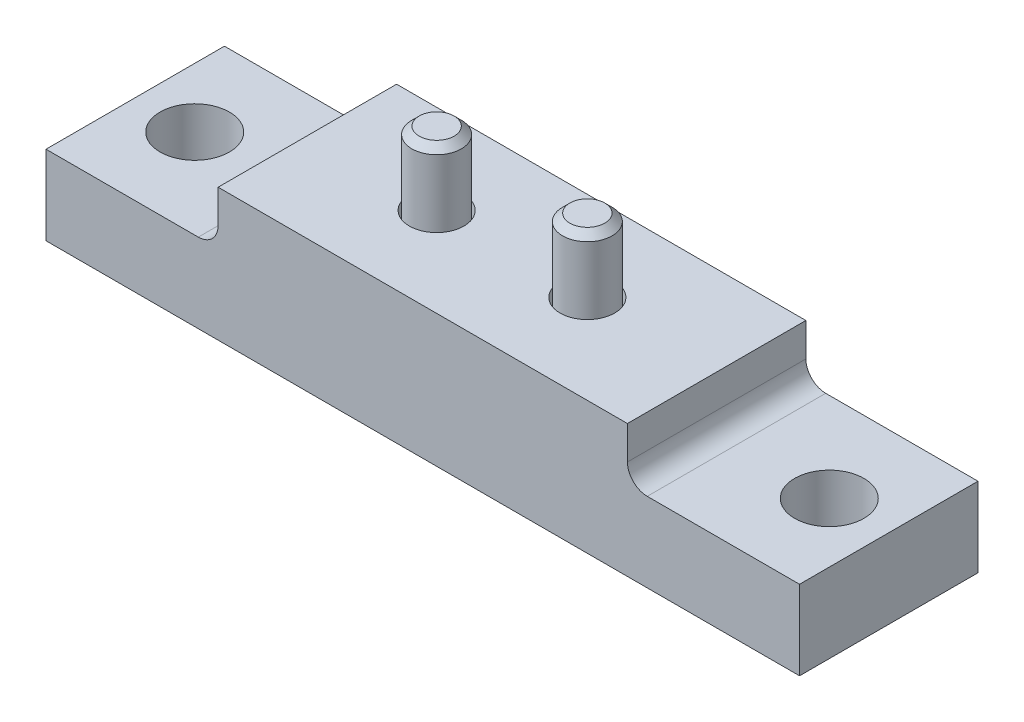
ISO-10303-21;
HEADER;
FILE_DESCRIPTION(('STEP AP214'),'2;1');
FILE_NAME('part.step','',(''),(''),'','','');
FILE_SCHEMA(('AUTOMOTIVE_DESIGN { 1 0 10303 214 1 1 1 1 }'));
ENDSEC;
DATA;
#1=APPLICATION_CONTEXT('core data for automotive mechanical design processes');
#2=APPLICATION_PROTOCOL_DEFINITION('international standard','automotive_design',2000,#1);
#3=PRODUCT_CONTEXT('',#1,'mechanical');
#4=PRODUCT('Part','Part','',(#3));
#5=PRODUCT_RELATED_PRODUCT_CATEGORY('part','',(#4));
#6=PRODUCT_DEFINITION_FORMATION('','',#4);
#7=PRODUCT_DEFINITION_CONTEXT('part definition',#1,'design');
#8=PRODUCT_DEFINITION('design','',#6,#7);
#9=PRODUCT_DEFINITION_SHAPE('','',#8);
#10=(LENGTH_UNIT() NAMED_UNIT(*) SI_UNIT(.MILLI.,.METRE.));
#11=(NAMED_UNIT(*) PLANE_ANGLE_UNIT() SI_UNIT($,.RADIAN.));
#12=(NAMED_UNIT(*) SI_UNIT($,.STERADIAN.) SOLID_ANGLE_UNIT());
#13=UNCERTAINTY_MEASURE_WITH_UNIT(LENGTH_MEASURE(1.E-05),#10,'distance_accuracy_value','');
#14=(GEOMETRIC_REPRESENTATION_CONTEXT(3) GLOBAL_UNCERTAINTY_ASSIGNED_CONTEXT((#13)) GLOBAL_UNIT_ASSIGNED_CONTEXT((#10,
#11,#12)) REPRESENTATION_CONTEXT('',''));
#15=CARTESIAN_POINT('',(0.,0.,0.));
#16=DIRECTION('',(0.,0.,1.));
#17=DIRECTION('',(1.,0.,0.));
#18=AXIS2_PLACEMENT_3D('',#15,#16,#17);
#19=CARTESIAN_POINT('',(8.88999999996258,-14.6431,-8.78823868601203));
#20=DIRECTION('',(0.,1.,0.));
#21=DIRECTION('',(0.,0.,1.));
#22=AXIS2_PLACEMENT_3D('',#19,#20,#21);
#23=PLANE('',#22);
#24=DIRECTION('',(0.,0.,-1.));
#25=VECTOR('',#24,1.);
#26=CARTESIAN_POINT('',(8.88999999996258,-14.6431,-12.4544128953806));
#27=LINE('',#26,#25);
#28=CARTESIAN_POINT('',(8.88999999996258,-14.6431,-12.4544128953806));
#29=VERTEX_POINT('',#28);
#30=CARTESIAN_POINT('',(8.88999999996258,-14.6431,-16.1205871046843));
#31=VERTEX_POINT('',#30);
#32=EDGE_CURVE('E346',#29,#31,#27,.T.);
#33=ORIENTED_EDGE('',*,*,#32,.T.);
#34=DIRECTION('',(0.866025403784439,0.,-0.5));
#35=VECTOR('',#34,1.);
#36=CARTESIAN_POINT('',(8.88999999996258,-14.6431,-16.1205871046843));
#37=LINE('',#36,#35);
#38=CARTESIAN_POINT('',(12.0650000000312,-14.6431,-17.9536742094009));
#39=VERTEX_POINT('',#38);
#40=EDGE_CURVE('E349',#31,#39,#37,.T.);
#41=ORIENTED_EDGE('',*,*,#40,.T.);
#42=DIRECTION('',(0.866025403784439,0.,0.5));
#43=VECTOR('',#42,1.);
#44=CARTESIAN_POINT('',(12.0650000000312,-14.6431,-17.9536742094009));
#45=LINE('',#44,#43);
#46=CARTESIAN_POINT('',(15.2399999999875,-14.6431,-16.1205871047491));
#47=VERTEX_POINT('',#46);
#48=EDGE_CURVE('E352',#39,#47,#45,.T.);
#49=ORIENTED_EDGE('',*,*,#48,.T.);
#50=DIRECTION('',(0.,0.,1.));
#51=VECTOR('',#50,1.);
#52=CARTESIAN_POINT('',(15.2399999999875,-14.6431,-16.1205871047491));
#53=LINE('',#52,#51);
#54=CARTESIAN_POINT('',(15.2399999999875,-14.6431,-12.4544128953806));
#55=VERTEX_POINT('',#54);
#56=EDGE_CURVE('E355',#47,#55,#53,.T.);
#57=ORIENTED_EDGE('',*,*,#56,.T.);
#58=DIRECTION('',(-0.866025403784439,0.,0.5));
#59=VECTOR('',#58,1.);
#60=CARTESIAN_POINT('',(15.2399999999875,-14.6431,-12.4544128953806));
#61=LINE('',#60,#59);
#62=CARTESIAN_POINT('',(12.064999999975,-14.6431,-10.6213257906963));
#63=VERTEX_POINT('',#62);
#64=EDGE_CURVE('E358',#55,#63,#61,.T.);
#65=ORIENTED_EDGE('',*,*,#64,.T.);
#66=DIRECTION('',(-0.866025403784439,0.,-0.5));
#67=VECTOR('',#66,1.);
#68=CARTESIAN_POINT('',(12.064999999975,-14.6431,-10.6213257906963));
#69=LINE('',#68,#67);
#70=EDGE_CURVE('E361',#63,#29,#69,.T.);
#71=ORIENTED_EDGE('',*,*,#70,.T.);
#72=EDGE_LOOP('',(#33,#41,#49,#57,#65,#71));
#73=FACE_BOUND('',#72,.T.);
#74=ADVANCED_FACE('F16',(#73),#23,.F.);
#75=CARTESIAN_POINT('',(8.88999999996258,-14.6431,-16.1205871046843));
#76=DIRECTION('',(-0.5,0.,-0.866025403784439));
#77=DIRECTION('',(0.866025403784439,0.,-0.5));
#78=AXIS2_PLACEMENT_3D('',#75,#76,#77);
#79=PLANE('',#78);
#80=DIRECTION('',(0.866025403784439,0.,-0.5));
#81=VECTOR('',#80,1.);
#82=CARTESIAN_POINT('',(8.88999999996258,-18.4785,-16.1205871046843));
#83=LINE('',#82,#81);
#84=CARTESIAN_POINT('',(8.88999999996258,-18.4785,-16.1205871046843));
#85=VERTEX_POINT('',#84);
#86=CARTESIAN_POINT('',(12.0650000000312,-18.4785,-17.9536742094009));
#87=VERTEX_POINT('',#86);
#88=EDGE_CURVE('E329',#85,#87,#83,.T.);
#89=ORIENTED_EDGE('',*,*,#88,.T.);
#90=DIRECTION('',(0.,-1.,0.));
#91=VECTOR('',#90,1.);
#92=CARTESIAN_POINT('',(12.0650000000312,-14.6431,-17.9536742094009));
#93=LINE('',#92,#91);
#94=EDGE_CURVE('E377',#39,#87,#93,.T.);
#95=ORIENTED_EDGE('',*,*,#94,.F.);
#96=ORIENTED_EDGE('',*,*,#40,.F.);
#97=DIRECTION('',(0.,-1.,0.));
#98=VECTOR('',#97,1.);
#99=CARTESIAN_POINT('',(8.88999999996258,-14.6431,-16.1205871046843));
#100=LINE('',#99,#98);
#101=EDGE_CURVE('E364',#31,#85,#100,.T.);
#102=ORIENTED_EDGE('',*,*,#101,.T.);
#103=EDGE_LOOP('',(#89,#95,#96,#102));
#104=FACE_BOUND('',#103,.T.);
#105=ADVANCED_FACE('F564',(#104),#79,.F.);
#106=CARTESIAN_POINT('',(12.0650000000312,-14.6431,-17.9536742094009));
#107=DIRECTION('',(0.5,0.,-0.866025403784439));
#108=DIRECTION('',(0.866025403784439,0.,0.5));
#109=AXIS2_PLACEMENT_3D('',#106,#107,#108);
#110=PLANE('',#109);
#111=DIRECTION('',(0.866025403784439,0.,0.5));
#112=VECTOR('',#111,1.);
#113=CARTESIAN_POINT('',(12.0650000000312,-18.4785,-17.9536742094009));
#114=LINE('',#113,#112);
#115=CARTESIAN_POINT('',(15.2399999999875,-18.4785,-16.1205871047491));
#116=VERTEX_POINT('',#115);
#117=EDGE_CURVE('E332',#87,#116,#114,.T.);
#118=ORIENTED_EDGE('',*,*,#117,.T.);
#119=DIRECTION('',(0.,-1.,0.));
#120=VECTOR('',#119,1.);
#121=CARTESIAN_POINT('',(15.2399999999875,-14.6431,-16.1205871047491));
#122=LINE('',#121,#120);
#123=EDGE_CURVE('E374',#47,#116,#122,.T.);
#124=ORIENTED_EDGE('',*,*,#123,.F.);
#125=ORIENTED_EDGE('',*,*,#48,.F.);
#126=ORIENTED_EDGE('',*,*,#94,.T.);
#127=EDGE_LOOP('',(#118,#124,#125,#126));
#128=FACE_BOUND('',#127,.T.);
#129=ADVANCED_FACE('F567',(#128),#110,.F.);
#130=CARTESIAN_POINT('',(15.2399999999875,-14.6431,-16.1205871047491));
#131=DIRECTION('',(1.,0.,0.));
#132=DIRECTION('',(0.,0.,1.));
#133=AXIS2_PLACEMENT_3D('',#130,#131,#132);
#134=PLANE('',#133);
#135=DIRECTION('',(0.,0.,1.));
#136=VECTOR('',#135,1.);
#137=CARTESIAN_POINT('',(15.2399999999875,-18.4785,-16.1205871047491));
#138=LINE('',#137,#136);
#139=CARTESIAN_POINT('',(15.2399999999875,-18.4785,-12.4544128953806));
#140=VERTEX_POINT('',#139);
#141=EDGE_CURVE('E337',#116,#140,#138,.T.);
#142=ORIENTED_EDGE('',*,*,#141,.T.);
#143=DIRECTION('',(0.,-1.,0.));
#144=VECTOR('',#143,1.);
#145=CARTESIAN_POINT('',(15.2399999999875,-14.6431,-12.4544128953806));
#146=LINE('',#145,#144);
#147=EDGE_CURVE('E371',#55,#140,#146,.T.);
#148=ORIENTED_EDGE('',*,*,#147,.F.);
#149=ORIENTED_EDGE('',*,*,#56,.F.);
#150=ORIENTED_EDGE('',*,*,#123,.T.);
#151=EDGE_LOOP('',(#142,#148,#149,#150));
#152=FACE_BOUND('',#151,.T.);
#153=ADVANCED_FACE('F571',(#152),#134,.F.);
#154=CARTESIAN_POINT('',(15.2399999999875,-14.6431,-12.4544128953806));
#155=DIRECTION('',(0.5,0.,0.866025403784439));
#156=DIRECTION('',(-0.866025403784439,0.,0.5));
#157=AXIS2_PLACEMENT_3D('',#154,#155,#156);
#158=PLANE('',#157);
#159=DIRECTION('',(-0.866025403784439,0.,0.5));
#160=VECTOR('',#159,1.);
#161=CARTESIAN_POINT('',(15.2399999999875,-18.4785,-12.4544128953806));
#162=LINE('',#161,#160);
#163=CARTESIAN_POINT('',(12.064999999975,-18.4785,-10.6213257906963));
#164=VERTEX_POINT('',#163);
#165=EDGE_CURVE('E340',#140,#164,#162,.T.);
#166=ORIENTED_EDGE('',*,*,#165,.T.);
#167=DIRECTION('',(0.,-1.,0.));
#168=VECTOR('',#167,1.);
#169=CARTESIAN_POINT('',(12.064999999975,-14.6431,-10.6213257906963));
#170=LINE('',#169,#168);
#171=EDGE_CURVE('E368',#63,#164,#170,.T.);
#172=ORIENTED_EDGE('',*,*,#171,.F.);
#173=ORIENTED_EDGE('',*,*,#64,.F.);
#174=ORIENTED_EDGE('',*,*,#147,.T.);
#175=EDGE_LOOP('',(#166,#172,#173,#174));
#176=FACE_BOUND('',#175,.T.);
#177=ADVANCED_FACE('F575',(#176),#158,.F.);
#178=CARTESIAN_POINT('',(12.064999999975,-14.6431,-10.6213257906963));
#179=DIRECTION('',(-0.5,0.,0.866025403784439));
#180=DIRECTION('',(-0.866025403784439,0.,-0.5));
#181=AXIS2_PLACEMENT_3D('',#178,#179,#180);
#182=PLANE('',#181);
#183=DIRECTION('',(-0.866025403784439,0.,-0.5));
#184=VECTOR('',#183,1.);
#185=CARTESIAN_POINT('',(12.064999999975,-18.4785,-10.6213257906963));
#186=LINE('',#185,#184);
#187=CARTESIAN_POINT('',(8.88999999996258,-18.4785,-12.4544128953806));
#188=VERTEX_POINT('',#187);
#189=EDGE_CURVE('E343',#164,#188,#186,.T.);
#190=ORIENTED_EDGE('',*,*,#189,.T.);
#191=DIRECTION('',(0.,-1.,0.));
#192=VECTOR('',#191,1.);
#193=CARTESIAN_POINT('',(8.88999999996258,-14.6431,-12.4544128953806));
#194=LINE('',#193,#192);
#195=EDGE_CURVE('E365',#29,#188,#194,.T.);
#196=ORIENTED_EDGE('',*,*,#195,.F.);
#197=ORIENTED_EDGE('',*,*,#70,.F.);
#198=ORIENTED_EDGE('',*,*,#171,.T.);
#199=EDGE_LOOP('',(#190,#196,#197,#198));
#200=FACE_BOUND('',#199,.T.);
#201=ADVANCED_FACE('F563',(#200),#182,.F.);
#202=CARTESIAN_POINT('',(8.88999999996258,-14.6431,-12.4544128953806));
#203=DIRECTION('',(-1.,0.,0.));
#204=DIRECTION('',(0.,0.,-1.));
#205=AXIS2_PLACEMENT_3D('',#202,#203,#204);
#206=PLANE('',#205);
#207=DIRECTION('',(0.,0.,-1.));
#208=VECTOR('',#207,1.);
#209=CARTESIAN_POINT('',(8.88999999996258,-18.4785,-12.4544128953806));
#210=LINE('',#209,#208);
#211=EDGE_CURVE('E35',#188,#85,#210,.T.);
#212=ORIENTED_EDGE('',*,*,#211,.T.);
#213=ORIENTED_EDGE('',*,*,#101,.F.);
#214=ORIENTED_EDGE('',*,*,#32,.F.);
#215=ORIENTED_EDGE('',*,*,#195,.T.);
#216=EDGE_LOOP('',(#212,#213,#214,#215));
#217=FACE_BOUND('',#216,.T.);
#218=ADVANCED_FACE('F547',(#217),#206,.F.);
#219=CARTESIAN_POINT('',(17.423384,-18.4785,-14.2875));
#220=DIRECTION('',(0.,-1.,0.));
#221=DIRECTION('',(0.,0.,-1.));
#222=AXIS2_PLACEMENT_3D('',#219,#220,#221);
#223=PLANE('',#222);
#224=ORIENTED_EDGE('',*,*,#211,.F.);
#225=ORIENTED_EDGE('',*,*,#189,.F.);
#226=ORIENTED_EDGE('',*,*,#165,.F.);
#227=ORIENTED_EDGE('',*,*,#141,.F.);
#228=ORIENTED_EDGE('',*,*,#117,.F.);
#229=ORIENTED_EDGE('',*,*,#88,.F.);
#230=EDGE_LOOP('',(#224,#225,#226,#227,#228,#229));
#231=FACE_BOUND('',#230,.T.);
#232=CARTESIAN_POINT('',(12.065,-18.4785,-14.2875));
#233=DIRECTION('',(0.,1.,0.));
#234=DIRECTION('',(0.,0.,1.));
#235=AXIS2_PLACEMENT_3D('',#232,#233,#234);
#236=CIRCLE('',#235,5.358384);
#237=CARTESIAN_POINT('',(12.065,-18.4785,-8.929116));
#238=VERTEX_POINT('',#237);
#239=EDGE_CURVE('E386',#238,#238,#236,.T.);
#240=ORIENTED_EDGE('',*,*,#239,.F.);
#241=EDGE_LOOP('',(#240));
#242=FACE_BOUND('',#241,.T.);
#243=ADVANCED_FACE('F543',(#231,#242),#223,.T.);
#244=CARTESIAN_POINT('',(12.065,-17.883124,-14.2875));
#245=DIRECTION('',(0.,1.,0.));
#246=DIRECTION('',(0.,0.,1.));
#247=AXIS2_PLACEMENT_3D('',#244,#245,#246);
#248=CONICAL_SURFACE('',#247,5.95376,0.785398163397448);
#249=ORIENTED_EDGE('',*,*,#239,.T.);
#250=EDGE_LOOP('',(#249));
#251=FACE_BOUND('',#250,.T.);
#252=CARTESIAN_POINT('',(12.065,-17.883124,-14.2875));
#253=DIRECTION('',(0.,1.,0.));
#254=DIRECTION('',(0.,0.,1.));
#255=AXIS2_PLACEMENT_3D('',#252,#253,#254);
#256=CIRCLE('',#255,5.95376);
#257=CARTESIAN_POINT('',(12.065,-17.883124,-8.33374));
#258=VERTEX_POINT('',#257);
#259=EDGE_CURVE('E389',#258,#258,#256,.T.);
#260=ORIENTED_EDGE('',*,*,#259,.F.);
#261=EDGE_LOOP('',(#260));
#262=FACE_BOUND('',#261,.T.);
#263=ADVANCED_FACE('F539',(#251,#262),#248,.T.);
#264=CARTESIAN_POINT('',(12.065,-10.541,-14.2875));
#265=DIRECTION('',(0.,1.,0.));
#266=DIRECTION('',(0.,0.,1.));
#267=AXIS2_PLACEMENT_3D('',#264,#265,#266);
#268=CYLINDRICAL_SURFACE('',#267,5.95376);
#269=ORIENTED_EDGE('',*,*,#259,.T.);
#270=EDGE_LOOP('',(#269));
#271=FACE_BOUND('',#270,.T.);
#272=CARTESIAN_POINT('',(12.065,-10.541,-14.2875));
#273=DIRECTION('',(0.,1.,0.));
#274=DIRECTION('',(0.,0.,1.));
#275=AXIS2_PLACEMENT_3D('',#272,#273,#274);
#276=CIRCLE('',#275,5.95376);
#277=CARTESIAN_POINT('',(12.065,-10.541,-8.33374));
#278=VERTEX_POINT('',#277);
#279=EDGE_CURVE('E392',#278,#278,#276,.T.);
#280=ORIENTED_EDGE('',*,*,#279,.F.);
#281=EDGE_LOOP('',(#280));
#282=FACE_BOUND('',#281,.T.);
#283=ADVANCED_FACE('F535',(#271,#282),#268,.T.);
#284=CARTESIAN_POINT('',(12.065,-10.541,-14.2875));
#285=DIRECTION('',(0.,1.,0.));
#286=DIRECTION('',(0.,0.,1.));
#287=AXIS2_PLACEMENT_3D('',#284,#285,#286);
#288=PLANE('',#287);
#289=CARTESIAN_POINT('',(12.065,-10.541,-14.2875));
#290=DIRECTION('',(0.,1.,0.));
#291=DIRECTION('',(0.,0.,1.));
#292=AXIS2_PLACEMENT_3D('',#289,#290,#291);
#293=CIRCLE('',#292,3.96875);
#294=CARTESIAN_POINT('',(12.065,-10.541,-10.31875));
#295=VERTEX_POINT('',#294);
#296=EDGE_CURVE('E26',#295,#295,#293,.T.);
#297=ORIENTED_EDGE('',*,*,#296,.F.);
#298=EDGE_LOOP('',(#297));
#299=FACE_BOUND('',#298,.T.);
#300=CARTESIAN_POINT('',(12.065,-10.541,-14.2875));
#301=DIRECTION('',(0.,1.,0.));
#302=DIRECTION('',(0.,0.,1.));
#303=AXIS2_PLACEMENT_3D('',#300,#301,#302);
#304=CIRCLE('',#303,4.3688);
#305=CARTESIAN_POINT('',(12.065,-10.541,-9.9187));
#306=VERTEX_POINT('',#305);
#307=EDGE_CURVE('E10',#306,#306,#304,.T.);
#308=ORIENTED_EDGE('',*,*,#307,.T.);
#309=EDGE_LOOP('',(#308));
#310=FACE_BOUND('',#309,.T.);
#311=ADVANCED_FACE('F531',(#299,#310),#288,.T.);
#312=CARTESIAN_POINT('',(12.065,11.684,-14.2875));
#313=DIRECTION('',(0.,1.,0.));
#314=DIRECTION('',(0.,0.,1.));
#315=AXIS2_PLACEMENT_3D('',#312,#313,#314);
#316=PLANE('',#315);
#317=CARTESIAN_POINT('',(12.065,11.684,-14.2875));
#318=DIRECTION('',(0.,1.,0.));
#319=DIRECTION('',(0.,0.,1.));
#320=AXIS2_PLACEMENT_3D('',#317,#318,#319);
#321=CIRCLE('',#320,2.79768935);
#322=CARTESIAN_POINT('',(12.065,11.684,-11.48981065));
#323=VERTEX_POINT('',#322);
#324=EDGE_CURVE('E383',#323,#323,#321,.T.);
#325=ORIENTED_EDGE('',*,*,#324,.T.);
#326=EDGE_LOOP('',(#325));
#327=FACE_BOUND('',#326,.T.);
#328=ADVANCED_FACE('F534',(#327),#316,.T.);
#329=CARTESIAN_POINT('',(12.065,11.684,-14.2875));
#330=DIRECTION('',(0.,-1.,0.));
#331=DIRECTION('',(0.,0.,-1.));
#332=AXIS2_PLACEMENT_3D('',#329,#330,#331);
#333=CONICAL_SURFACE('',#332,2.79768935,0.78539816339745);
#334=CARTESIAN_POINT('',(12.065,10.51293935,-14.2875));
#335=DIRECTION('',(0.,1.,0.));
#336=DIRECTION('',(0.,0.,1.));
#337=AXIS2_PLACEMENT_3D('',#334,#335,#336);
#338=CIRCLE('',#337,3.96875);
#339=CARTESIAN_POINT('',(12.065,10.51293935,-10.31875));
#340=VERTEX_POINT('',#339);
#341=EDGE_CURVE('E367',#340,#340,#338,.T.);
#342=ORIENTED_EDGE('',*,*,#341,.T.);
#343=EDGE_LOOP('',(#342));
#344=FACE_BOUND('',#343,.T.);
#345=ORIENTED_EDGE('',*,*,#324,.F.);
#346=EDGE_LOOP('',(#345));
#347=FACE_BOUND('',#346,.T.);
#348=ADVANCED_FACE('F551',(#344,#347),#333,.T.);
#349=CARTESIAN_POINT('',(12.065,-10.541,-14.2875));
#350=DIRECTION('',(0.,1.,0.));
#351=DIRECTION('',(0.,0.,1.));
#352=AXIS2_PLACEMENT_3D('',#349,#350,#351);
#353=CYLINDRICAL_SURFACE('',#352,3.96875);
#354=ORIENTED_EDGE('',*,*,#296,.T.);
#355=EDGE_LOOP('',(#354));
#356=FACE_BOUND('',#355,.T.);
#357=ORIENTED_EDGE('',*,*,#341,.F.);
#358=EDGE_LOOP('',(#357));
#359=FACE_BOUND('',#358,.T.);
#360=ADVANCED_FACE('F555',(#356,#359),#353,.T.);
#361=CARTESIAN_POINT('',(-15.2400000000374,-14.6431,-8.78823868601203));
#362=DIRECTION('',(0.,1.,0.));
#363=DIRECTION('',(0.,0.,1.));
#364=AXIS2_PLACEMENT_3D('',#361,#362,#363);
#365=PLANE('',#364);
#366=DIRECTION('',(0.,0.,-1.));
#367=VECTOR('',#366,1.);
#368=CARTESIAN_POINT('',(-15.2400000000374,-14.6431,-12.4544128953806));
#369=LINE('',#368,#367);
#370=CARTESIAN_POINT('',(-15.2400000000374,-14.6431,-12.4544128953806));
#371=VERTEX_POINT('',#370);
#372=CARTESIAN_POINT('',(-15.2400000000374,-14.6431,-16.1205871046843));
#373=VERTEX_POINT('',#372);
#374=EDGE_CURVE('E179',#371,#373,#369,.T.);
#375=ORIENTED_EDGE('',*,*,#374,.T.);
#376=DIRECTION('',(0.866025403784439,0.,-0.5));
#377=VECTOR('',#376,1.);
#378=CARTESIAN_POINT('',(-15.2400000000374,-14.6431,-16.1205871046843));
#379=LINE('',#378,#377);
#380=CARTESIAN_POINT('',(-12.0649999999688,-14.6431,-17.9536742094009));
#381=VERTEX_POINT('',#380);
#382=EDGE_CURVE('E157',#373,#381,#379,.T.);
#383=ORIENTED_EDGE('',*,*,#382,.T.);
#384=DIRECTION('',(0.866025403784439,0.,0.5));
#385=VECTOR('',#384,1.);
#386=CARTESIAN_POINT('',(-12.0649999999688,-14.6431,-17.9536742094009));
#387=LINE('',#386,#385);
#388=CARTESIAN_POINT('',(-8.89000000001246,-14.6431,-16.1205871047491));
#389=VERTEX_POINT('',#388);
#390=EDGE_CURVE('E182',#381,#389,#387,.T.);
#391=ORIENTED_EDGE('',*,*,#390,.T.);
#392=DIRECTION('',(0.,0.,1.));
#393=VECTOR('',#392,1.);
#394=CARTESIAN_POINT('',(-8.89000000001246,-14.6431,-16.1205871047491));
#395=LINE('',#394,#393);
#396=CARTESIAN_POINT('',(-8.89000000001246,-14.6431,-12.4544128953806));
#397=VERTEX_POINT('',#396);
#398=EDGE_CURVE('E185',#389,#397,#395,.T.);
#399=ORIENTED_EDGE('',*,*,#398,.T.);
#400=DIRECTION('',(-0.866025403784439,0.,0.5));
#401=VECTOR('',#400,1.);
#402=CARTESIAN_POINT('',(-8.89000000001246,-14.6431,-12.4544128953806));
#403=LINE('',#402,#401);
#404=CARTESIAN_POINT('',(-12.0650000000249,-14.6431,-10.6213257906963));
#405=VERTEX_POINT('',#404);
#406=EDGE_CURVE('E188',#397,#405,#403,.T.);
#407=ORIENTED_EDGE('',*,*,#406,.T.);
#408=DIRECTION('',(-0.866025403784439,0.,-0.5));
#409=VECTOR('',#408,1.);
#410=CARTESIAN_POINT('',(-12.0650000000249,-14.6431,-10.6213257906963));
#411=LINE('',#410,#409);
#412=EDGE_CURVE('E160',#405,#371,#411,.T.);
#413=ORIENTED_EDGE('',*,*,#412,.T.);
#414=EDGE_LOOP('',(#375,#383,#391,#399,#407,#413));
#415=FACE_BOUND('',#414,.T.);
#416=ADVANCED_FACE('F559',(#415),#365,.F.);
#417=CARTESIAN_POINT('',(-15.2400000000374,-14.6431,-16.1205871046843));
#418=DIRECTION('',(-0.5,0.,-0.866025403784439));
#419=DIRECTION('',(0.866025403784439,0.,-0.5));
#420=AXIS2_PLACEMENT_3D('',#417,#418,#419);
#421=PLANE('',#420);
#422=DIRECTION('',(0.866025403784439,0.,-0.5));
#423=VECTOR('',#422,1.);
#424=CARTESIAN_POINT('',(-15.2400000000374,-18.4785,-16.1205871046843));
#425=LINE('',#424,#423);
#426=CARTESIAN_POINT('',(-15.2400000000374,-18.4785,-16.1205871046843));
#427=VERTEX_POINT('',#426);
#428=CARTESIAN_POINT('',(-12.0649999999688,-18.4785,-17.9536742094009));
#429=VERTEX_POINT('',#428);
#430=EDGE_CURVE('E150',#427,#429,#425,.T.);
#431=ORIENTED_EDGE('',*,*,#430,.T.);
#432=DIRECTION('',(0.,-1.,0.));
#433=VECTOR('',#432,1.);
#434=CARTESIAN_POINT('',(-12.0649999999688,-14.6431,-17.9536742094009));
#435=LINE('',#434,#433);
#436=EDGE_CURVE('E159',#381,#429,#435,.T.);
#437=ORIENTED_EDGE('',*,*,#436,.F.);
#438=ORIENTED_EDGE('',*,*,#382,.F.);
#439=DIRECTION('',(0.,-1.,0.));
#440=VECTOR('',#439,1.);
#441=CARTESIAN_POINT('',(-15.2400000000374,-14.6431,-16.1205871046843));
#442=LINE('',#441,#440);
#443=EDGE_CURVE('E145',#373,#427,#442,.T.);
#444=ORIENTED_EDGE('',*,*,#443,.T.);
#445=EDGE_LOOP('',(#431,#437,#438,#444));
#446=FACE_BOUND('',#445,.T.);
#447=ADVANCED_FACE('F154',(#446),#421,.F.);
#448=CARTESIAN_POINT('',(-12.0649999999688,-14.6431,-17.9536742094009));
#449=DIRECTION('',(0.5,0.,-0.866025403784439));
#450=DIRECTION('',(0.866025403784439,0.,0.5));
#451=AXIS2_PLACEMENT_3D('',#448,#449,#450);
#452=PLANE('',#451);
#453=DIRECTION('',(0.866025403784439,0.,0.5));
#454=VECTOR('',#453,1.);
#455=CARTESIAN_POINT('',(-12.0649999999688,-18.4785,-17.9536742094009));
#456=LINE('',#455,#454);
#457=CARTESIAN_POINT('',(-8.89000000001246,-18.4785,-16.1205871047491));
#458=VERTEX_POINT('',#457);
#459=EDGE_CURVE('E166',#429,#458,#456,.T.);
#460=ORIENTED_EDGE('',*,*,#459,.T.);
#461=DIRECTION('',(0.,-1.,0.));
#462=VECTOR('',#461,1.);
#463=CARTESIAN_POINT('',(-8.89000000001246,-14.6431,-16.1205871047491));
#464=LINE('',#463,#462);
#465=EDGE_CURVE('E199',#389,#458,#464,.T.);
#466=ORIENTED_EDGE('',*,*,#465,.F.);
#467=ORIENTED_EDGE('',*,*,#390,.F.);
#468=ORIENTED_EDGE('',*,*,#436,.T.);
#469=EDGE_LOOP('',(#460,#466,#467,#468));
#470=FACE_BOUND('',#469,.T.);
#471=ADVANCED_FACE('F594',(#470),#452,.F.);
#472=CARTESIAN_POINT('',(-8.89000000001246,-14.6431,-16.1205871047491));
#473=DIRECTION('',(1.,0.,0.));
#474=DIRECTION('',(0.,0.,1.));
#475=AXIS2_PLACEMENT_3D('',#472,#473,#474);
#476=PLANE('',#475);
#477=DIRECTION('',(0.,0.,1.));
#478=VECTOR('',#477,1.);
#479=CARTESIAN_POINT('',(-8.89000000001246,-18.4785,-16.1205871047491));
#480=LINE('',#479,#478);
#481=CARTESIAN_POINT('',(-8.89000000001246,-18.4785,-12.4544128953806));
#482=VERTEX_POINT('',#481);
#483=EDGE_CURVE('E168',#458,#482,#480,.T.);
#484=ORIENTED_EDGE('',*,*,#483,.T.);
#485=DIRECTION('',(0.,-1.,0.));
#486=VECTOR('',#485,1.);
#487=CARTESIAN_POINT('',(-8.89000000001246,-14.6431,-12.4544128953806));
#488=LINE('',#487,#486);
#489=EDGE_CURVE('E197',#397,#482,#488,.T.);
#490=ORIENTED_EDGE('',*,*,#489,.F.);
#491=ORIENTED_EDGE('',*,*,#398,.F.);
#492=ORIENTED_EDGE('',*,*,#465,.T.);
#493=EDGE_LOOP('',(#484,#490,#491,#492));
#494=FACE_BOUND('',#493,.T.);
#495=ADVANCED_FACE('F603',(#494),#476,.F.);
#496=CARTESIAN_POINT('',(-8.89000000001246,-14.6431,-12.4544128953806));
#497=DIRECTION('',(0.5,0.,0.866025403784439));
#498=DIRECTION('',(-0.866025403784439,0.,0.5));
#499=AXIS2_PLACEMENT_3D('',#496,#497,#498);
#500=PLANE('',#499);
#501=DIRECTION('',(-0.866025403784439,0.,0.5));
#502=VECTOR('',#501,1.);
#503=CARTESIAN_POINT('',(-8.89000000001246,-18.4785,-12.4544128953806));
#504=LINE('',#503,#502);
#505=CARTESIAN_POINT('',(-12.0650000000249,-18.4785,-10.6213257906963));
#506=VERTEX_POINT('',#505);
#507=EDGE_CURVE('E174',#482,#506,#504,.T.);
#508=ORIENTED_EDGE('',*,*,#507,.T.);
#509=DIRECTION('',(0.,-1.,0.));
#510=VECTOR('',#509,1.);
#511=CARTESIAN_POINT('',(-12.0650000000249,-14.6431,-10.6213257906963));
#512=LINE('',#511,#510);
#513=EDGE_CURVE('E195',#405,#506,#512,.T.);
#514=ORIENTED_EDGE('',*,*,#513,.F.);
#515=ORIENTED_EDGE('',*,*,#406,.F.);
#516=ORIENTED_EDGE('',*,*,#489,.T.);
#517=EDGE_LOOP('',(#508,#514,#515,#516));
#518=FACE_BOUND('',#517,.T.);
#519=ADVANCED_FACE('F600',(#518),#500,.F.);
#520=CARTESIAN_POINT('',(-12.0650000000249,-14.6431,-10.6213257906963));
#521=DIRECTION('',(-0.5,0.,0.866025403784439));
#522=DIRECTION('',(-0.866025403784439,0.,-0.5));
#523=AXIS2_PLACEMENT_3D('',#520,#521,#522);
#524=PLANE('',#523);
#525=DIRECTION('',(-0.866025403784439,0.,-0.5));
#526=VECTOR('',#525,1.);
#527=CARTESIAN_POINT('',(-12.0650000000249,-18.4785,-10.6213257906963));
#528=LINE('',#527,#526);
#529=CARTESIAN_POINT('',(-15.2400000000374,-18.4785,-12.4544128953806));
#530=VERTEX_POINT('',#529);
#531=EDGE_CURVE('E177',#506,#530,#528,.T.);
#532=ORIENTED_EDGE('',*,*,#531,.T.);
#533=DIRECTION('',(0.,-1.,0.));
#534=VECTOR('',#533,1.);
#535=CARTESIAN_POINT('',(-15.2400000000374,-14.6431,-12.4544128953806));
#536=LINE('',#535,#534);
#537=EDGE_CURVE('E137',#371,#530,#536,.T.);
#538=ORIENTED_EDGE('',*,*,#537,.F.);
#539=ORIENTED_EDGE('',*,*,#412,.F.);
#540=ORIENTED_EDGE('',*,*,#513,.T.);
#541=EDGE_LOOP('',(#532,#538,#539,#540));
#542=FACE_BOUND('',#541,.T.);
#543=ADVANCED_FACE('F597',(#542),#524,.F.);
#544=CARTESIAN_POINT('',(-15.2400000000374,-14.6431,-12.4544128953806));
#545=DIRECTION('',(-1.,0.,0.));
#546=DIRECTION('',(0.,0.,-1.));
#547=AXIS2_PLACEMENT_3D('',#544,#545,#546);
#548=PLANE('',#547);
#549=DIRECTION('',(0.,0.,-1.));
#550=VECTOR('',#549,1.);
#551=CARTESIAN_POINT('',(-15.2400000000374,-18.4785,-12.4544128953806));
#552=LINE('',#551,#550);
#553=EDGE_CURVE('E142',#530,#427,#552,.T.);
#554=ORIENTED_EDGE('',*,*,#553,.T.);
#555=ORIENTED_EDGE('',*,*,#443,.F.);
#556=ORIENTED_EDGE('',*,*,#374,.F.);
#557=ORIENTED_EDGE('',*,*,#537,.T.);
#558=EDGE_LOOP('',(#554,#555,#556,#557));
#559=FACE_BOUND('',#558,.T.);
#560=ADVANCED_FACE('F144',(#559),#548,.F.);
#561=CARTESIAN_POINT('',(-6.706616,-18.4785,-14.2875));
#562=DIRECTION('',(0.,-1.,0.));
#563=DIRECTION('',(0.,0.,-1.));
#564=AXIS2_PLACEMENT_3D('',#561,#562,#563);
#565=PLANE('',#564);
#566=ORIENTED_EDGE('',*,*,#553,.F.);
#567=ORIENTED_EDGE('',*,*,#531,.F.);
#568=ORIENTED_EDGE('',*,*,#507,.F.);
#569=ORIENTED_EDGE('',*,*,#483,.F.);
#570=ORIENTED_EDGE('',*,*,#459,.F.);
#571=ORIENTED_EDGE('',*,*,#430,.F.);
#572=EDGE_LOOP('',(#566,#567,#568,#569,#570,#571));
#573=FACE_BOUND('',#572,.T.);
#574=CARTESIAN_POINT('',(-12.065,-18.4785,-14.2875));
#575=DIRECTION('',(0.,1.,0.));
#576=DIRECTION('',(0.,0.,1.));
#577=AXIS2_PLACEMENT_3D('',#574,#575,#576);
#578=CIRCLE('',#577,5.358384);
#579=CARTESIAN_POINT('',(-12.065,-18.4785,-8.929116));
#580=VERTEX_POINT('',#579);
#581=EDGE_CURVE('E207',#580,#580,#578,.T.);
#582=ORIENTED_EDGE('',*,*,#581,.F.);
#583=EDGE_LOOP('',(#582));
#584=FACE_BOUND('',#583,.T.);
#585=ADVANCED_FACE('F162',(#573,#584),#565,.T.);
#586=CARTESIAN_POINT('',(-12.065,11.684,-14.2875));
#587=DIRECTION('',(0.,1.,0.));
#588=DIRECTION('',(0.,0.,1.));
#589=AXIS2_PLACEMENT_3D('',#586,#587,#588);
#590=PLANE('',#589);
#591=CARTESIAN_POINT('',(-12.065,11.684,-14.2875));
#592=DIRECTION('',(0.,1.,0.));
#593=DIRECTION('',(0.,0.,1.));
#594=AXIS2_PLACEMENT_3D('',#591,#592,#593);
#595=CIRCLE('',#594,2.79768935);
#596=CARTESIAN_POINT('',(-12.065,11.684,-11.48981065));
#597=VERTEX_POINT('',#596);
#598=EDGE_CURVE('E204',#597,#597,#595,.T.);
#599=ORIENTED_EDGE('',*,*,#598,.T.);
#600=EDGE_LOOP('',(#599));
#601=FACE_BOUND('',#600,.T.);
#602=ADVANCED_FACE('F621',(#601),#590,.T.);
#603=CARTESIAN_POINT('',(-12.065,-17.883124,-14.2875));
#604=DIRECTION('',(0.,1.,0.));
#605=DIRECTION('',(0.,0.,1.));
#606=AXIS2_PLACEMENT_3D('',#603,#604,#605);
#607=CONICAL_SURFACE('',#606,5.95376,0.785398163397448);
#608=ORIENTED_EDGE('',*,*,#581,.T.);
#609=EDGE_LOOP('',(#608));
#610=FACE_BOUND('',#609,.T.);
#611=CARTESIAN_POINT('',(-12.065,-17.883124,-14.2875));
#612=DIRECTION('',(0.,1.,0.));
#613=DIRECTION('',(0.,0.,1.));
#614=AXIS2_PLACEMENT_3D('',#611,#612,#613);
#615=CIRCLE('',#614,5.95376);
#616=CARTESIAN_POINT('',(-12.065,-17.883124,-8.33374));
#617=VERTEX_POINT('',#616);
#618=EDGE_CURVE('E209',#617,#617,#615,.T.);
#619=ORIENTED_EDGE('',*,*,#618,.F.);
#620=EDGE_LOOP('',(#619));
#621=FACE_BOUND('',#620,.T.);
#622=ADVANCED_FACE('F619',(#610,#621),#607,.T.);
#623=CARTESIAN_POINT('',(-12.065,11.684,-14.2875));
#624=DIRECTION('',(0.,-1.,0.));
#625=DIRECTION('',(0.,0.,-1.));
#626=AXIS2_PLACEMENT_3D('',#623,#624,#625);
#627=CONICAL_SURFACE('',#626,2.79768935,0.78539816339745);
#628=CARTESIAN_POINT('',(-12.065,10.51293935,-14.2875));
#629=DIRECTION('',(0.,1.,0.));
#630=DIRECTION('',(0.,0.,1.));
#631=AXIS2_PLACEMENT_3D('',#628,#629,#630);
#632=CIRCLE('',#631,3.96875);
#633=CARTESIAN_POINT('',(-12.065,10.51293935,-10.31875));
#634=VERTEX_POINT('',#633);
#635=EDGE_CURVE('E194',#634,#634,#632,.T.);
#636=ORIENTED_EDGE('',*,*,#635,.T.);
#637=EDGE_LOOP('',(#636));
#638=FACE_BOUND('',#637,.T.);
#639=ORIENTED_EDGE('',*,*,#598,.F.);
#640=EDGE_LOOP('',(#639));
#641=FACE_BOUND('',#640,.T.);
#642=ADVANCED_FACE('F616',(#638,#641),#627,.T.);
#643=CARTESIAN_POINT('',(-12.065,-10.541,-14.2875));
#644=DIRECTION('',(0.,1.,0.));
#645=DIRECTION('',(0.,0.,1.));
#646=AXIS2_PLACEMENT_3D('',#643,#644,#645);
#647=CYLINDRICAL_SURFACE('',#646,5.95376);
#648=ORIENTED_EDGE('',*,*,#618,.T.);
#649=EDGE_LOOP('',(#648));
#650=FACE_BOUND('',#649,.T.);
#651=CARTESIAN_POINT('',(-12.065,-10.541,-14.2875));
#652=DIRECTION('',(0.,1.,0.));
#653=DIRECTION('',(0.,0.,1.));
#654=AXIS2_PLACEMENT_3D('',#651,#652,#653);
#655=CIRCLE('',#654,5.95376);
#656=CARTESIAN_POINT('',(-12.065,-10.541,-8.33374));
#657=VERTEX_POINT('',#656);
#658=EDGE_CURVE('E325',#657,#657,#655,.T.);
#659=ORIENTED_EDGE('',*,*,#658,.F.);
#660=EDGE_LOOP('',(#659));
#661=FACE_BOUND('',#660,.T.);
#662=ADVANCED_FACE('F615',(#650,#661),#647,.T.);
#663=CARTESIAN_POINT('',(-12.065,-10.541,-14.2875));
#664=DIRECTION('',(0.,1.,0.));
#665=DIRECTION('',(0.,0.,1.));
#666=AXIS2_PLACEMENT_3D('',#663,#664,#665);
#667=CYLINDRICAL_SURFACE('',#666,3.96875);
#668=CARTESIAN_POINT('',(-12.065,-10.541,-14.2875));
#669=DIRECTION('',(0.,1.,0.));
#670=DIRECTION('',(0.,0.,1.));
#671=AXIS2_PLACEMENT_3D('',#668,#669,#670);
#672=CIRCLE('',#671,3.96875);
#673=CARTESIAN_POINT('',(-12.065,-10.541,-10.31875));
#674=VERTEX_POINT('',#673);
#675=EDGE_CURVE('E20',#674,#674,#672,.T.);
#676=ORIENTED_EDGE('',*,*,#675,.T.);
#677=EDGE_LOOP('',(#676));
#678=FACE_BOUND('',#677,.T.);
#679=ORIENTED_EDGE('',*,*,#635,.F.);
#680=EDGE_LOOP('',(#679));
#681=FACE_BOUND('',#680,.T.);
#682=ADVANCED_FACE('F515',(#678,#681),#667,.T.);
#683=CARTESIAN_POINT('',(-16.4338,-10.541,-14.2875));
#684=DIRECTION('',(0.,1.,0.));
#685=DIRECTION('',(0.,0.,-1.));
#686=AXIS2_PLACEMENT_3D('',#683,#684,#685);
#687=PLANE('',#686);
#688=ORIENTED_EDGE('',*,*,#658,.T.);
#689=EDGE_LOOP('',(#688));
#690=FACE_BOUND('',#689,.T.);
#691=CARTESIAN_POINT('',(-12.065,-10.541,-14.2875));
#692=DIRECTION('',(0.,-1.,0.));
#693=DIRECTION('',(0.,0.,1.));
#694=AXIS2_PLACEMENT_3D('',#691,#692,#693);
#695=CIRCLE('',#694,7.112);
#696=CARTESIAN_POINT('',(-12.065,-10.541,-7.1755));
#697=VERTEX_POINT('',#696);
#698=EDGE_CURVE('E272',#697,#697,#695,.T.);
#699=ORIENTED_EDGE('',*,*,#698,.T.);
#700=EDGE_LOOP('',(#699));
#701=FACE_BOUND('',#700,.T.);
#702=ADVANCED_FACE('F489',(#690,#701),#687,.F.);
#703=CARTESIAN_POINT('',(60.325,-8.509,-28.575));
#704=DIRECTION('',(0.,-1.,0.));
#705=DIRECTION('',(0.,0.,1.));
#706=AXIS2_PLACEMENT_3D('',#703,#704,#705);
#707=PLANE('',#706);
#708=DIRECTION('',(1.,0.,0.));
#709=VECTOR('',#708,1.);
#710=CARTESIAN_POINT('',(60.325,-8.509,-28.575));
#711=LINE('',#710,#709);
#712=CARTESIAN_POINT('',(35.941,-8.509,-28.575));
#713=VERTEX_POINT('',#712);
#714=CARTESIAN_POINT('',(60.325,-8.509,-28.575));
#715=VERTEX_POINT('',#714);
#716=EDGE_CURVE('E238',#713,#715,#711,.T.);
#717=ORIENTED_EDGE('',*,*,#716,.F.);
#718=DIRECTION('',(0.,0.,1.));
#719=VECTOR('',#718,1.);
#720=CARTESIAN_POINT('',(35.941,-8.509,0.));
#721=LINE('',#720,#719);
#722=CARTESIAN_POINT('',(35.941,-8.509,0.));
#723=VERTEX_POINT('',#722);
#724=EDGE_CURVE('E304',#713,#723,#721,.T.);
#725=ORIENTED_EDGE('',*,*,#724,.T.);
#726=DIRECTION('',(1.,0.,0.));
#727=VECTOR('',#726,1.);
#728=CARTESIAN_POINT('',(60.325,-8.509,0.));
#729=LINE('',#728,#727);
#730=CARTESIAN_POINT('',(60.325,-8.509,0.));
#731=VERTEX_POINT('',#730);
#732=EDGE_CURVE('E239',#723,#731,#729,.T.);
#733=ORIENTED_EDGE('',*,*,#732,.T.);
#734=DIRECTION('',(0.,0.,1.));
#735=VECTOR('',#734,1.);
#736=CARTESIAN_POINT('',(60.325,-8.509,-28.575));
#737=LINE('',#736,#735);
#738=EDGE_CURVE('E246',#715,#731,#737,.T.);
#739=ORIENTED_EDGE('',*,*,#738,.F.);
#740=EDGE_LOOP('',(#717,#725,#733,#739));
#741=FACE_BOUND('',#740,.T.);
#742=CARTESIAN_POINT('',(50.8,-8.509,-14.2875));
#743=DIRECTION('',(0.,-1.,0.));
#744=DIRECTION('',(0.,0.,1.));
#745=AXIS2_PLACEMENT_3D('',#742,#743,#744);
#746=CIRCLE('',#745,5.5499);
#747=CARTESIAN_POINT('',(50.8,-8.509,-8.7376));
#748=VERTEX_POINT('',#747);
#749=EDGE_CURVE('E249',#748,#748,#746,.F.);
#750=ORIENTED_EDGE('',*,*,#749,.F.);
#751=EDGE_LOOP('',(#750));
#752=FACE_BOUND('',#751,.T.);
#753=ADVANCED_FACE('F425',(#741,#752),#707,.F.);
#754=CARTESIAN_POINT('',(35.941,-5.334,-28.575));
#755=DIRECTION('',(0.,0.,-1.));
#756=DIRECTION('',(1.,0.,0.));
#757=AXIS2_PLACEMENT_3D('',#754,#755,#756);
#758=CYLINDRICAL_SURFACE('',#757,3.175);
#759=CARTESIAN_POINT('',(35.941,-5.334,-28.575));
#760=DIRECTION('',(0.,0.,1.));
#761=DIRECTION('',(-1.,0.,0.));
#762=AXIS2_PLACEMENT_3D('',#759,#760,#761);
#763=CIRCLE('',#762,3.175);
#764=CARTESIAN_POINT('',(32.766,-5.334,-28.575));
#765=VERTEX_POINT('',#764);
#766=EDGE_CURVE('E320',#765,#713,#763,.T.);
#767=ORIENTED_EDGE('',*,*,#766,.F.);
#768=DIRECTION('',(0.,0.,1.));
#769=VECTOR('',#768,1.);
#770=CARTESIAN_POINT('',(32.766,-5.334,-28.575));
#771=LINE('',#770,#769);
#772=CARTESIAN_POINT('',(32.766,-5.334,0.));
#773=VERTEX_POINT('',#772);
#774=EDGE_CURVE('E311',#773,#765,#771,.F.);
#775=ORIENTED_EDGE('',*,*,#774,.F.);
#776=CARTESIAN_POINT('',(35.941,-5.334,0.));
#777=DIRECTION('',(0.,0.,-1.));
#778=DIRECTION('',(1.,0.,0.));
#779=AXIS2_PLACEMENT_3D('',#776,#777,#778);
#780=CIRCLE('',#779,3.175);
#781=EDGE_CURVE('E318',#723,#773,#780,.T.);
#782=ORIENTED_EDGE('',*,*,#781,.F.);
#783=ORIENTED_EDGE('',*,*,#724,.F.);
#784=EDGE_LOOP('',(#767,#775,#782,#783));
#785=FACE_BOUND('',#784,.T.);
#786=ADVANCED_FACE('F422',(#785),#758,.F.);
#787=CARTESIAN_POINT('',(-35.941,-5.334,-28.575));
#788=DIRECTION('',(0.,0.,-1.));
#789=DIRECTION('',(1.,0.,0.));
#790=AXIS2_PLACEMENT_3D('',#787,#788,#789);
#791=CYLINDRICAL_SURFACE('',#790,3.175);
#792=CARTESIAN_POINT('',(-35.941,-5.334,-28.575));
#793=DIRECTION('',(0.,0.,1.));
#794=DIRECTION('',(-1.,0.,0.));
#795=AXIS2_PLACEMENT_3D('',#792,#793,#794);
#796=CIRCLE('',#795,3.175);
#797=CARTESIAN_POINT('',(-35.941,-8.509,-28.575));
#798=VERTEX_POINT('',#797);
#799=CARTESIAN_POINT('',(-32.766,-5.334,-28.575));
#800=VERTEX_POINT('',#799);
#801=EDGE_CURVE('E324',#798,#800,#796,.T.);
#802=ORIENTED_EDGE('',*,*,#801,.F.);
#803=DIRECTION('',(0.,0.,1.));
#804=VECTOR('',#803,1.);
#805=CARTESIAN_POINT('',(-35.941,-8.509,-28.575));
#806=LINE('',#805,#804);
#807=CARTESIAN_POINT('',(-35.941,-8.509,0.));
#808=VERTEX_POINT('',#807);
#809=EDGE_CURVE('E316',#808,#798,#806,.F.);
#810=ORIENTED_EDGE('',*,*,#809,.F.);
#811=CARTESIAN_POINT('',(-35.941,-5.334,0.));
#812=DIRECTION('',(0.,0.,-1.));
#813=DIRECTION('',(1.,0.,0.));
#814=AXIS2_PLACEMENT_3D('',#811,#812,#813);
#815=CIRCLE('',#814,3.175);
#816=CARTESIAN_POINT('',(-32.766,-5.334,0.));
#817=VERTEX_POINT('',#816);
#818=EDGE_CURVE('E322',#817,#808,#815,.T.);
#819=ORIENTED_EDGE('',*,*,#818,.F.);
#820=DIRECTION('',(0.,0.,1.));
#821=VECTOR('',#820,1.);
#822=CARTESIAN_POINT('',(-32.766,-5.334,0.));
#823=LINE('',#822,#821);
#824=EDGE_CURVE('E313',#800,#817,#823,.T.);
#825=ORIENTED_EDGE('',*,*,#824,.F.);
#826=EDGE_LOOP('',(#802,#810,#819,#825));
#827=FACE_BOUND('',#826,.T.);
#828=ADVANCED_FACE('F445',(#827),#791,.F.);
#829=CARTESIAN_POINT('',(-60.325,-8.509,-28.575));
#830=DIRECTION('',(0.,-1.,0.));
#831=DIRECTION('',(0.,0.,1.));
#832=AXIS2_PLACEMENT_3D('',#829,#830,#831);
#833=PLANE('',#832);
#834=DIRECTION('',(1.,0.,0.));
#835=VECTOR('',#834,1.);
#836=CARTESIAN_POINT('',(-60.325,-8.509,0.));
#837=LINE('',#836,#835);
#838=CARTESIAN_POINT('',(-60.325,-8.509,0.));
#839=VERTEX_POINT('',#838);
#840=EDGE_CURVE('E214',#839,#808,#837,.T.);
#841=ORIENTED_EDGE('',*,*,#840,.T.);
#842=ORIENTED_EDGE('',*,*,#809,.T.);
#843=DIRECTION('',(1.,0.,0.));
#844=VECTOR('',#843,1.);
#845=CARTESIAN_POINT('',(-60.325,-8.509,-28.575));
#846=LINE('',#845,#844);
#847=CARTESIAN_POINT('',(-60.325,-8.509,-28.575));
#848=VERTEX_POINT('',#847);
#849=EDGE_CURVE('E223',#848,#798,#846,.T.);
#850=ORIENTED_EDGE('',*,*,#849,.F.);
#851=DIRECTION('',(0.,0.,1.));
#852=VECTOR('',#851,1.);
#853=CARTESIAN_POINT('',(-60.325,-8.509,-28.575));
#854=LINE('',#853,#852);
#855=EDGE_CURVE('E233',#848,#839,#854,.T.);
#856=ORIENTED_EDGE('',*,*,#855,.T.);
#857=EDGE_LOOP('',(#841,#842,#850,#856));
#858=FACE_BOUND('',#857,.T.);
#859=CARTESIAN_POINT('',(-50.8,-8.509,-14.2875));
#860=DIRECTION('',(0.,-1.,0.));
#861=DIRECTION('',(0.,0.,1.));
#862=AXIS2_PLACEMENT_3D('',#859,#860,#861);
#863=CIRCLE('',#862,5.5499);
#864=CARTESIAN_POINT('',(-50.8,-8.509,-8.7376));
#865=VERTEX_POINT('',#864);
#866=EDGE_CURVE('E232',#865,#865,#863,.F.);
#867=ORIENTED_EDGE('',*,*,#866,.F.);
#868=EDGE_LOOP('',(#867));
#869=FACE_BOUND('',#868,.T.);
#870=ADVANCED_FACE('F442',(#858,#869),#833,.F.);
#871=CARTESIAN_POINT('',(-12.065,-10.541,-14.2875));
#872=DIRECTION('',(0.,1.,0.));
#873=DIRECTION('',(0.,0.,1.));
#874=AXIS2_PLACEMENT_3D('',#871,#872,#873);
#875=PLANE('',#874);
#876=ORIENTED_EDGE('',*,*,#675,.F.);
#877=EDGE_LOOP('',(#876));
#878=FACE_BOUND('',#877,.T.);
#879=CARTESIAN_POINT('',(-12.065,-10.541,-14.2875));
#880=DIRECTION('',(0.,-1.,0.));
#881=DIRECTION('',(0.,0.,1.));
#882=AXIS2_PLACEMENT_3D('',#879,#880,#881);
#883=CIRCLE('',#882,4.3688);
#884=CARTESIAN_POINT('',(-12.065,-10.541,-9.9187));
#885=VERTEX_POINT('',#884);
#886=EDGE_CURVE('E269',#885,#885,#883,.T.);
#887=ORIENTED_EDGE('',*,*,#886,.F.);
#888=EDGE_LOOP('',(#887));
#889=FACE_BOUND('',#888,.T.);
#890=ADVANCED_FACE('F18',(#878,#889),#875,.T.);
#891=CARTESIAN_POINT('',(-60.325,-21.209,-28.575));
#892=DIRECTION('',(1.,0.,0.));
#893=DIRECTION('',(0.,0.,1.));
#894=AXIS2_PLACEMENT_3D('',#891,#892,#893);
#895=PLANE('',#894);
#896=DIRECTION('',(0.,1.,0.));
#897=VECTOR('',#896,1.);
#898=CARTESIAN_POINT('',(-60.325,-21.209,0.));
#899=LINE('',#898,#897);
#900=CARTESIAN_POINT('',(-60.325,-21.209,0.));
#901=VERTEX_POINT('',#900);
#902=EDGE_CURVE('E298',#901,#839,#899,.T.);
#903=ORIENTED_EDGE('',*,*,#902,.T.);
#904=ORIENTED_EDGE('',*,*,#855,.F.);
#905=DIRECTION('',(0.,1.,0.));
#906=VECTOR('',#905,1.);
#907=CARTESIAN_POINT('',(-60.325,-21.209,-28.575));
#908=LINE('',#907,#906);
#909=CARTESIAN_POINT('',(-60.325,-21.209,-28.575));
#910=VERTEX_POINT('',#909);
#911=EDGE_CURVE('E295',#910,#848,#908,.T.);
#912=ORIENTED_EDGE('',*,*,#911,.F.);
#913=DIRECTION('',(0.,0.,-1.));
#914=VECTOR('',#913,1.);
#915=CARTESIAN_POINT('',(-60.325,-21.209,-28.575));
#916=LINE('',#915,#914);
#917=EDGE_CURVE('E285',#901,#910,#916,.T.);
#918=ORIENTED_EDGE('',*,*,#917,.F.);
#919=EDGE_LOOP('',(#903,#904,#912,#918));
#920=FACE_BOUND('',#919,.T.);
#921=ADVANCED_FACE('F441',(#920),#895,.F.);
#922=CARTESIAN_POINT('',(32.766,0.,-28.575));
#923=DIRECTION('',(-1.,0.,0.));
#924=DIRECTION('',(0.,0.,-1.));
#925=AXIS2_PLACEMENT_3D('',#922,#923,#924);
#926=PLANE('',#925);
#927=DIRECTION('',(0.,-1.,0.));
#928=VECTOR('',#927,1.);
#929=CARTESIAN_POINT('',(32.766,0.,0.));
#930=LINE('',#929,#928);
#931=CARTESIAN_POINT('',(32.766,0.,0.));
#932=VERTEX_POINT('',#931);
#933=EDGE_CURVE('E242',#932,#773,#930,.T.);
#934=ORIENTED_EDGE('',*,*,#933,.T.);
#935=ORIENTED_EDGE('',*,*,#774,.T.);
#936=DIRECTION('',(0.,-1.,0.));
#937=VECTOR('',#936,1.);
#938=CARTESIAN_POINT('',(32.766,0.,-28.575));
#939=LINE('',#938,#937);
#940=CARTESIAN_POINT('',(32.766,0.,-28.575));
#941=VERTEX_POINT('',#940);
#942=EDGE_CURVE('E235',#941,#765,#939,.T.);
#943=ORIENTED_EDGE('',*,*,#942,.F.);
#944=DIRECTION('',(0.,0.,1.));
#945=VECTOR('',#944,1.);
#946=CARTESIAN_POINT('',(32.766,0.,-28.575));
#947=LINE('',#946,#945);
#948=EDGE_CURVE('E241',#941,#932,#947,.T.);
#949=ORIENTED_EDGE('',*,*,#948,.T.);
#950=EDGE_LOOP('',(#934,#935,#943,#949));
#951=FACE_BOUND('',#950,.T.);
#952=ADVANCED_FACE('F414',(#951),#926,.F.);
#953=CARTESIAN_POINT('',(60.325,-21.209,0.));
#954=DIRECTION('',(0.,0.,-1.));
#955=DIRECTION('',(1.,0.,0.));
#956=AXIS2_PLACEMENT_3D('',#953,#954,#955);
#957=PLANE('',#956);
#958=DIRECTION('',(-1.,0.,0.));
#959=VECTOR('',#958,1.);
#960=CARTESIAN_POINT('',(60.325,0.,0.));
#961=LINE('',#960,#959);
#962=CARTESIAN_POINT('',(-32.766,0.,0.));
#963=VERTEX_POINT('',#962);
#964=EDGE_CURVE('E278',#932,#963,#961,.T.);
#965=ORIENTED_EDGE('',*,*,#964,.T.);
#966=DIRECTION('',(0.,1.,0.));
#967=VECTOR('',#966,1.);
#968=CARTESIAN_POINT('',(-32.766,0.,0.));
#969=LINE('',#968,#967);
#970=EDGE_CURVE('E218',#817,#963,#969,.T.);
#971=ORIENTED_EDGE('',*,*,#970,.F.);
#972=ORIENTED_EDGE('',*,*,#818,.T.);
#973=ORIENTED_EDGE('',*,*,#840,.F.);
#974=ORIENTED_EDGE('',*,*,#902,.F.);
#975=DIRECTION('',(-1.,0.,0.));
#976=VECTOR('',#975,1.);
#977=CARTESIAN_POINT('',(60.325,-21.209,0.));
#978=LINE('',#977,#976);
#979=CARTESIAN_POINT('',(60.325,-21.209,0.));
#980=VERTEX_POINT('',#979);
#981=EDGE_CURVE('E282',#980,#901,#978,.T.);
#982=ORIENTED_EDGE('',*,*,#981,.F.);
#983=DIRECTION('',(0.,1.,0.));
#984=VECTOR('',#983,1.);
#985=CARTESIAN_POINT('',(60.325,-21.209,0.));
#986=LINE('',#985,#984);
#987=EDGE_CURVE('E301',#980,#731,#986,.T.);
#988=ORIENTED_EDGE('',*,*,#987,.T.);
#989=ORIENTED_EDGE('',*,*,#732,.F.);
#990=ORIENTED_EDGE('',*,*,#781,.T.);
#991=ORIENTED_EDGE('',*,*,#933,.F.);
#992=EDGE_LOOP('',(#965,#971,#972,#973,#974,#982,#988,#989,#990,#991));
#993=FACE_BOUND('',#992,.T.);
#994=ADVANCED_FACE('F417',(#993),#957,.F.);
#995=CARTESIAN_POINT('',(-32.766,0.,-28.575));
#996=DIRECTION('',(1.,0.,0.));
#997=DIRECTION('',(0.,0.,1.));
#998=AXIS2_PLACEMENT_3D('',#995,#996,#997);
#999=PLANE('',#998);
#1000=DIRECTION('',(0.,1.,0.));
#1001=VECTOR('',#1000,1.);
#1002=CARTESIAN_POINT('',(-32.766,0.,-28.575));
#1003=LINE('',#1002,#1001);
#1004=CARTESIAN_POINT('',(-32.766,0.,-28.575));
#1005=VERTEX_POINT('',#1004);
#1006=EDGE_CURVE('E226',#800,#1005,#1003,.T.);
#1007=ORIENTED_EDGE('',*,*,#1006,.F.);
#1008=ORIENTED_EDGE('',*,*,#824,.T.);
#1009=ORIENTED_EDGE('',*,*,#970,.T.);
#1010=DIRECTION('',(0.,0.,1.));
#1011=VECTOR('',#1010,1.);
#1012=CARTESIAN_POINT('',(-32.766,0.,-28.575));
#1013=LINE('',#1012,#1011);
#1014=EDGE_CURVE('E229',#1005,#963,#1013,.T.);
#1015=ORIENTED_EDGE('',*,*,#1014,.F.);
#1016=EDGE_LOOP('',(#1007,#1008,#1009,#1015));
#1017=FACE_BOUND('',#1016,.T.);
#1018=ADVANCED_FACE('F406',(#1017),#999,.F.);
#1019=CARTESIAN_POINT('',(60.325,-21.209,-28.575));
#1020=DIRECTION('',(0.,0.,1.));
#1021=DIRECTION('',(-1.,0.,0.));
#1022=AXIS2_PLACEMENT_3D('',#1019,#1020,#1021);
#1023=PLANE('',#1022);
#1024=ORIENTED_EDGE('',*,*,#849,.T.);
#1025=ORIENTED_EDGE('',*,*,#801,.T.);
#1026=ORIENTED_EDGE('',*,*,#1006,.T.);
#1027=DIRECTION('',(1.,0.,0.));
#1028=VECTOR('',#1027,1.);
#1029=CARTESIAN_POINT('',(60.325,0.,-28.575));
#1030=LINE('',#1029,#1028);
#1031=EDGE_CURVE('E283',#1005,#941,#1030,.T.);
#1032=ORIENTED_EDGE('',*,*,#1031,.T.);
#1033=ORIENTED_EDGE('',*,*,#942,.T.);
#1034=ORIENTED_EDGE('',*,*,#766,.T.);
#1035=ORIENTED_EDGE('',*,*,#716,.T.);
#1036=DIRECTION('',(0.,1.,0.));
#1037=VECTOR('',#1036,1.);
#1038=CARTESIAN_POINT('',(60.325,-21.209,-28.575));
#1039=LINE('',#1038,#1037);
#1040=CARTESIAN_POINT('',(60.325,-21.209,-28.575));
#1041=VERTEX_POINT('',#1040);
#1042=EDGE_CURVE('E289',#1041,#715,#1039,.T.);
#1043=ORIENTED_EDGE('',*,*,#1042,.F.);
#1044=DIRECTION('',(1.,0.,0.));
#1045=VECTOR('',#1044,1.);
#1046=CARTESIAN_POINT('',(60.325,-21.209,-28.575));
#1047=LINE('',#1046,#1045);
#1048=EDGE_CURVE('E287',#910,#1041,#1047,.T.);
#1049=ORIENTED_EDGE('',*,*,#1048,.F.);
#1050=ORIENTED_EDGE('',*,*,#911,.T.);
#1051=EDGE_LOOP('',(#1024,#1025,#1026,#1032,#1033,#1034,#1035,#1043,#1049,#1050));
#1052=FACE_BOUND('',#1051,.T.);
#1053=ADVANCED_FACE('F401',(#1052),#1023,.F.);
#1054=CARTESIAN_POINT('',(-12.065,-21.209,-14.2875));
#1055=DIRECTION('',(0.,-1.,0.));
#1056=DIRECTION('',(0.,0.,1.));
#1057=AXIS2_PLACEMENT_3D('',#1054,#1055,#1056);
#1058=CYLINDRICAL_SURFACE('',#1057,4.3688);
#1059=CARTESIAN_POINT('',(-12.065,0.,-14.2875));
#1060=DIRECTION('',(0.,-1.,0.));
#1061=DIRECTION('',(0.,0.,1.));
#1062=AXIS2_PLACEMENT_3D('',#1059,#1060,#1061);
#1063=CIRCLE('',#1062,4.3688);
#1064=CARTESIAN_POINT('',(-12.065,0.,-9.9187));
#1065=VERTEX_POINT('',#1064);
#1066=EDGE_CURVE('E266',#1065,#1065,#1063,.T.);
#1067=ORIENTED_EDGE('',*,*,#1066,.F.);
#1068=EDGE_LOOP('',(#1067));
#1069=FACE_BOUND('',#1068,.T.);
#1070=ORIENTED_EDGE('',*,*,#886,.T.);
#1071=EDGE_LOOP('',(#1070));
#1072=FACE_BOUND('',#1071,.T.);
#1073=ADVANCED_FACE('F502',(#1069,#1072),#1058,.F.);
#1074=CARTESIAN_POINT('',(60.325,0.,-28.575));
#1075=DIRECTION('',(0.,-1.,0.));
#1076=DIRECTION('',(0.,0.,1.));
#1077=AXIS2_PLACEMENT_3D('',#1074,#1075,#1076);
#1078=PLANE('',#1077);
#1079=CARTESIAN_POINT('',(12.065,0.,-14.2875));
#1080=DIRECTION('',(0.,-1.,0.));
#1081=DIRECTION('',(0.,0.,1.));
#1082=AXIS2_PLACEMENT_3D('',#1079,#1080,#1081);
#1083=CIRCLE('',#1082,4.3688);
#1084=CARTESIAN_POINT('',(12.065,0.,-9.9187));
#1085=VERTEX_POINT('',#1084);
#1086=EDGE_CURVE('E257',#1085,#1085,#1083,.T.);
#1087=ORIENTED_EDGE('',*,*,#1086,.T.);
#1088=EDGE_LOOP('',(#1087));
#1089=FACE_BOUND('',#1088,.T.);
#1090=ORIENTED_EDGE('',*,*,#1066,.T.);
#1091=EDGE_LOOP('',(#1090));
#1092=FACE_BOUND('',#1091,.T.);
#1093=ORIENTED_EDGE('',*,*,#1031,.F.);
#1094=ORIENTED_EDGE('',*,*,#1014,.T.);
#1095=ORIENTED_EDGE('',*,*,#964,.F.);
#1096=ORIENTED_EDGE('',*,*,#948,.F.);
#1097=EDGE_LOOP('',(#1093,#1094,#1095,#1096));
#1098=FACE_BOUND('',#1097,.T.);
#1099=ADVANCED_FACE('F411',(#1089,#1092,#1098),#1078,.F.);
#1100=CARTESIAN_POINT('',(12.065,-21.209,-14.2875));
#1101=DIRECTION('',(0.,-1.,0.));
#1102=DIRECTION('',(0.,0.,1.));
#1103=AXIS2_PLACEMENT_3D('',#1100,#1101,#1102);
#1104=CYLINDRICAL_SURFACE('',#1103,4.3688);
#1105=ORIENTED_EDGE('',*,*,#1086,.F.);
#1106=EDGE_LOOP('',(#1105));
#1107=FACE_BOUND('',#1106,.T.);
#1108=ORIENTED_EDGE('',*,*,#307,.F.);
#1109=EDGE_LOOP('',(#1108));
#1110=FACE_BOUND('',#1109,.T.);
#1111=ADVANCED_FACE('F493',(#1107,#1110),#1104,.F.);
#1112=CARTESIAN_POINT('',(60.325,-21.209,-28.575));
#1113=DIRECTION('',(-1.,0.,0.));
#1114=DIRECTION('',(0.,0.,-1.));
#1115=AXIS2_PLACEMENT_3D('',#1112,#1113,#1114);
#1116=PLANE('',#1115);
#1117=ORIENTED_EDGE('',*,*,#1042,.T.);
#1118=ORIENTED_EDGE('',*,*,#738,.T.);
#1119=ORIENTED_EDGE('',*,*,#987,.F.);
#1120=DIRECTION('',(0.,0.,1.));
#1121=VECTOR('',#1120,1.);
#1122=CARTESIAN_POINT('',(60.325,-21.209,-28.575));
#1123=LINE('',#1122,#1121);
#1124=EDGE_CURVE('E279',#1041,#980,#1123,.T.);
#1125=ORIENTED_EDGE('',*,*,#1124,.F.);
#1126=EDGE_LOOP('',(#1117,#1118,#1119,#1125));
#1127=FACE_BOUND('',#1126,.T.);
#1128=ADVANCED_FACE('F433',(#1127),#1116,.F.);
#1129=CARTESIAN_POINT('',(-12.065,-21.209,-14.2875));
#1130=DIRECTION('',(0.,-1.,0.));
#1131=DIRECTION('',(0.,0.,1.));
#1132=AXIS2_PLACEMENT_3D('',#1129,#1130,#1131);
#1133=CYLINDRICAL_SURFACE('',#1132,7.112);
#1134=ORIENTED_EDGE('',*,*,#698,.F.);
#1135=EDGE_LOOP('',(#1134));
#1136=FACE_BOUND('',#1135,.T.);
#1137=CARTESIAN_POINT('',(-12.065,-21.209,-14.2875));
#1138=DIRECTION('',(0.,-1.,0.));
#1139=DIRECTION('',(0.,0.,1.));
#1140=AXIS2_PLACEMENT_3D('',#1137,#1138,#1139);
#1141=CIRCLE('',#1140,7.112);
#1142=CARTESIAN_POINT('',(-12.065,-21.209,-7.1755));
#1143=VERTEX_POINT('',#1142);
#1144=EDGE_CURVE('E275',#1143,#1143,#1141,.T.);
#1145=ORIENTED_EDGE('',*,*,#1144,.T.);
#1146=EDGE_LOOP('',(#1145));
#1147=FACE_BOUND('',#1146,.T.);
#1148=ADVANCED_FACE('F473',(#1136,#1147),#1133,.F.);
#1149=CARTESIAN_POINT('',(-50.8,-21.209,-14.2875));
#1150=DIRECTION('',(0.,-1.,0.));
#1151=DIRECTION('',(0.,0.,1.));
#1152=AXIS2_PLACEMENT_3D('',#1149,#1150,#1151);
#1153=CYLINDRICAL_SURFACE('',#1152,5.5499);
#1154=ORIENTED_EDGE('',*,*,#866,.T.);
#1155=EDGE_LOOP('',(#1154));
#1156=FACE_BOUND('',#1155,.T.);
#1157=CARTESIAN_POINT('',(-50.8,-21.209,-14.2875));
#1158=DIRECTION('',(0.,-1.,0.));
#1159=DIRECTION('',(0.,0.,1.));
#1160=AXIS2_PLACEMENT_3D('',#1157,#1158,#1159);
#1161=CIRCLE('',#1160,5.5499);
#1162=CARTESIAN_POINT('',(-50.8,-21.209,-8.7376));
#1163=VERTEX_POINT('',#1162);
#1164=EDGE_CURVE('E254',#1163,#1163,#1161,.T.);
#1165=ORIENTED_EDGE('',*,*,#1164,.T.);
#1166=EDGE_LOOP('',(#1165));
#1167=FACE_BOUND('',#1166,.T.);
#1168=ADVANCED_FACE('F462',(#1156,#1167),#1153,.F.);
#1169=CARTESIAN_POINT('',(50.8,-21.209,-14.2875));
#1170=DIRECTION('',(0.,-1.,0.));
#1171=DIRECTION('',(0.,0.,1.));
#1172=AXIS2_PLACEMENT_3D('',#1169,#1170,#1171);
#1173=CYLINDRICAL_SURFACE('',#1172,5.5499);
#1174=ORIENTED_EDGE('',*,*,#749,.T.);
#1175=EDGE_LOOP('',(#1174));
#1176=FACE_BOUND('',#1175,.T.);
#1177=CARTESIAN_POINT('',(50.8,-21.209,-14.2875));
#1178=DIRECTION('',(0.,-1.,0.));
#1179=DIRECTION('',(0.,0.,1.));
#1180=AXIS2_PLACEMENT_3D('',#1177,#1178,#1179);
#1181=CIRCLE('',#1180,5.5499);
#1182=CARTESIAN_POINT('',(50.8,-21.209,-8.7376));
#1183=VERTEX_POINT('',#1182);
#1184=EDGE_CURVE('E251',#1183,#1183,#1181,.T.);
#1185=ORIENTED_EDGE('',*,*,#1184,.T.);
#1186=EDGE_LOOP('',(#1185));
#1187=FACE_BOUND('',#1186,.T.);
#1188=ADVANCED_FACE('F470',(#1176,#1187),#1173,.F.);
#1189=CARTESIAN_POINT('',(60.325,-21.209,-28.575));
#1190=DIRECTION('',(0.,-1.,0.));
#1191=DIRECTION('',(0.,0.,1.));
#1192=AXIS2_PLACEMENT_3D('',#1189,#1190,#1191);
#1193=PLANE('',#1192);
#1194=ORIENTED_EDGE('',*,*,#1184,.F.);
#1195=EDGE_LOOP('',(#1194));
#1196=FACE_BOUND('',#1195,.T.);
#1197=ORIENTED_EDGE('',*,*,#1164,.F.);
#1198=EDGE_LOOP('',(#1197));
#1199=FACE_BOUND('',#1198,.T.);
#1200=CARTESIAN_POINT('',(12.065,-21.209,-14.2875));
#1201=DIRECTION('',(0.,-1.,0.));
#1202=DIRECTION('',(0.,0.,1.));
#1203=AXIS2_PLACEMENT_3D('',#1200,#1201,#1202);
#1204=CIRCLE('',#1203,7.112);
#1205=CARTESIAN_POINT('',(12.065,-21.209,-7.1755));
#1206=VERTEX_POINT('',#1205);
#1207=EDGE_CURVE('E263',#1206,#1206,#1204,.T.);
#1208=ORIENTED_EDGE('',*,*,#1207,.F.);
#1209=EDGE_LOOP('',(#1208));
#1210=FACE_BOUND('',#1209,.T.);
#1211=ORIENTED_EDGE('',*,*,#1144,.F.);
#1212=EDGE_LOOP('',(#1211));
#1213=FACE_BOUND('',#1212,.T.);
#1214=ORIENTED_EDGE('',*,*,#1124,.T.);
#1215=ORIENTED_EDGE('',*,*,#981,.T.);
#1216=ORIENTED_EDGE('',*,*,#917,.T.);
#1217=ORIENTED_EDGE('',*,*,#1048,.T.);
#1218=EDGE_LOOP('',(#1214,#1215,#1216,#1217));
#1219=FACE_BOUND('',#1218,.T.);
#1220=ADVANCED_FACE('F435',(#1196,#1199,#1210,#1213,#1219),#1193,.T.);
#1221=CARTESIAN_POINT('',(12.065,-21.209,-14.2875));
#1222=DIRECTION('',(0.,-1.,0.));
#1223=DIRECTION('',(0.,0.,1.));
#1224=AXIS2_PLACEMENT_3D('',#1221,#1222,#1223);
#1225=CYLINDRICAL_SURFACE('',#1224,7.112);
#1226=CARTESIAN_POINT('',(12.065,-10.541,-14.2875));
#1227=DIRECTION('',(0.,-1.,0.));
#1228=DIRECTION('',(0.,0.,1.));
#1229=AXIS2_PLACEMENT_3D('',#1226,#1227,#1228);
#1230=CIRCLE('',#1229,7.112);
#1231=CARTESIAN_POINT('',(12.065,-10.541,-7.1755));
#1232=VERTEX_POINT('',#1231);
#1233=EDGE_CURVE('E260',#1232,#1232,#1230,.T.);
#1234=ORIENTED_EDGE('',*,*,#1233,.F.);
#1235=EDGE_LOOP('',(#1234));
#1236=FACE_BOUND('',#1235,.T.);
#1237=ORIENTED_EDGE('',*,*,#1207,.T.);
#1238=EDGE_LOOP('',(#1237));
#1239=FACE_BOUND('',#1238,.T.);
#1240=ADVANCED_FACE('F458',(#1236,#1239),#1225,.F.);
#1241=CARTESIAN_POINT('',(7.6962,-10.541,-14.2875));
#1242=DIRECTION('',(0.,1.,0.));
#1243=DIRECTION('',(0.,0.,-1.));
#1244=AXIS2_PLACEMENT_3D('',#1241,#1242,#1243);
#1245=PLANE('',#1244);
#1246=ORIENTED_EDGE('',*,*,#279,.T.);
#1247=EDGE_LOOP('',(#1246));
#1248=FACE_BOUND('',#1247,.T.);
#1249=ORIENTED_EDGE('',*,*,#1233,.T.);
#1250=EDGE_LOOP('',(#1249));
#1251=FACE_BOUND('',#1250,.T.);
#1252=ADVANCED_FACE('F455',(#1248,#1251),#1245,.F.);
#1253=CLOSED_SHELL('',(#74,#105,#129,#153,#177,#201,#218,#243,#263,#283,#311,#328,#348,#360,
#416,#447,#471,#495,#519,#543,#560,#585,#602,#622,#642,#662,#682,#702,#753,#786,#828,#870,#890,
#921,#952,#994,#1018,#1053,#1073,#1099,#1111,#1128,#1148,#1168,#1188,#1220,#1240,#1252));
#1254=MANIFOLD_SOLID_BREP('B1',#1253);
#1255=ADVANCED_BREP_SHAPE_REPRESENTATION('',(#18,#1254),#14);
#1256=SHAPE_DEFINITION_REPRESENTATION(#9,#1255);
ENDSEC;
END-ISO-10303-21;
